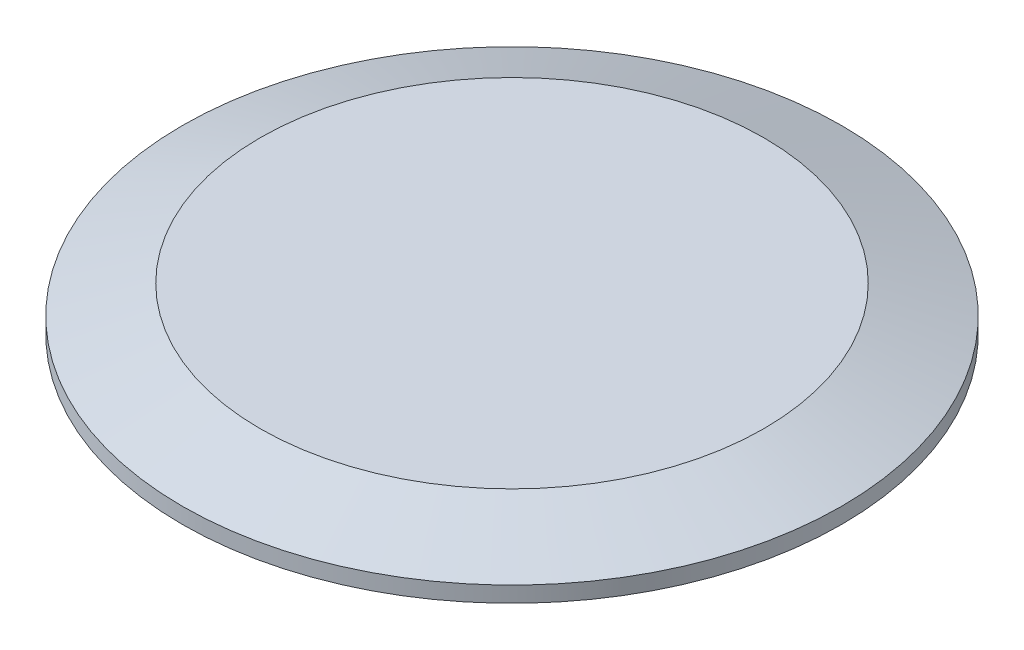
from build123d import *


with BuildPart() as part:
    # Sketch1 → Revolve1 (revolve)
    with BuildSketch(Plane.XY):
        with BuildLine():
            Line((0, 0), (-52.982491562, 0))
            ThreePointArc((-52.982491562, 0), (-53.414688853, 0.129217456), (-53.705033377, 0.474458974))
            ThreePointArc((-53.705033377, 0.474458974), (-54.8005, 1.1938), (-55.895966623, 0.474458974))
            ThreePointArc((-55.895966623, 0.474458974), (-56.186311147, 0.129217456), (-56.618508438, 0))
            Line((-56.618508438, 0), (-59.4614, 0))
            Line((-59.4614, 0), (-59.4614, 2.8448))
            Line((-59.4614, 2.8448), (-45.434428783, 7.9502))
            Line((-45.434428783, 7.9502), (0, 7.9502))
            Line((0, 7.9502), (0, 0))
        make_face()
    revolve(axis=Axis((0, 7.9502, 0), (0, -1, 0)))


solid = part.part
